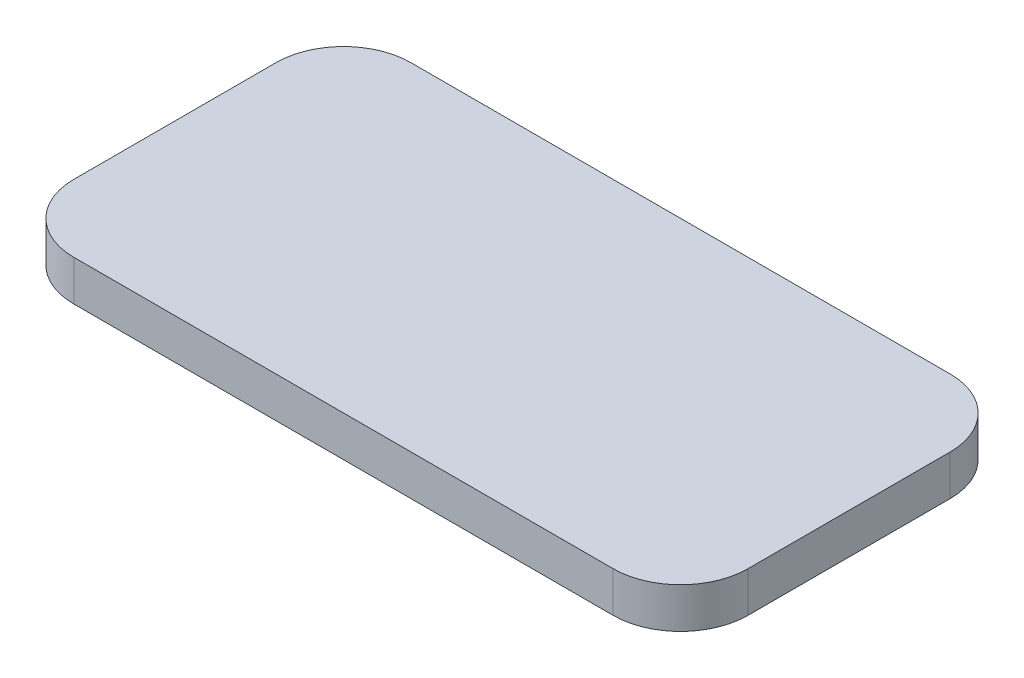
ISO-10303-21;
HEADER;
FILE_DESCRIPTION(('STEP AP214'),'2;1');
FILE_NAME('part.step','',(''),(''),'','','');
FILE_SCHEMA(('AUTOMOTIVE_DESIGN { 1 0 10303 214 1 1 1 1 }'));
ENDSEC;
DATA;
#1=APPLICATION_CONTEXT('core data for automotive mechanical design processes');
#2=APPLICATION_PROTOCOL_DEFINITION('international standard','automotive_design',2000,#1);
#3=PRODUCT_CONTEXT('',#1,'mechanical');
#4=PRODUCT('Part','Part','',(#3));
#5=PRODUCT_RELATED_PRODUCT_CATEGORY('part','',(#4));
#6=PRODUCT_DEFINITION_FORMATION('','',#4);
#7=PRODUCT_DEFINITION_CONTEXT('part definition',#1,'design');
#8=PRODUCT_DEFINITION('design','',#6,#7);
#9=PRODUCT_DEFINITION_SHAPE('','',#8);
#10=(LENGTH_UNIT() NAMED_UNIT(*) SI_UNIT(.MILLI.,.METRE.));
#11=(NAMED_UNIT(*) PLANE_ANGLE_UNIT() SI_UNIT($,.RADIAN.));
#12=(NAMED_UNIT(*) SI_UNIT($,.STERADIAN.) SOLID_ANGLE_UNIT());
#13=UNCERTAINTY_MEASURE_WITH_UNIT(LENGTH_MEASURE(1.E-05),#10,'distance_accuracy_value','');
#14=(GEOMETRIC_REPRESENTATION_CONTEXT(3) GLOBAL_UNCERTAINTY_ASSIGNED_CONTEXT((#13)) GLOBAL_UNIT_ASSIGNED_CONTEXT((#10,
#11,#12)) REPRESENTATION_CONTEXT('',''));
#15=CARTESIAN_POINT('',(0.,0.,0.));
#16=DIRECTION('',(0.,0.,1.));
#17=DIRECTION('',(1.,0.,0.));
#18=AXIS2_PLACEMENT_3D('',#15,#16,#17);
#19=CARTESIAN_POINT('',(5.,3.,-20.));
#20=DIRECTION('',(0.,-1.,0.));
#21=DIRECTION('',(0.,0.,-1.));
#22=AXIS2_PLACEMENT_3D('',#19,#20,#21);
#23=CYLINDRICAL_SURFACE('',#22,5.);
#24=CARTESIAN_POINT('',(5.,0.,-20.));
#25=DIRECTION('',(0.,1.,0.));
#26=DIRECTION('',(0.,0.,1.));
#27=AXIS2_PLACEMENT_3D('',#24,#25,#26);
#28=CIRCLE('',#27,5.);
#29=CARTESIAN_POINT('',(5.,0.,-25.));
#30=VERTEX_POINT('',#29);
#31=CARTESIAN_POINT('',(0.,0.,-20.));
#32=VERTEX_POINT('',#31);
#33=EDGE_CURVE('E96',#30,#32,#28,.T.);
#34=ORIENTED_EDGE('',*,*,#33,.T.);
#35=DIRECTION('',(0.,-1.,0.));
#36=VECTOR('',#35,1.);
#37=CARTESIAN_POINT('',(0.,3.,-20.));
#38=LINE('',#37,#36);
#39=CARTESIAN_POINT('',(0.,3.,-20.));
#40=VERTEX_POINT('',#39);
#41=EDGE_CURVE('E11',#40,#32,#38,.T.);
#42=ORIENTED_EDGE('',*,*,#41,.F.);
#43=CARTESIAN_POINT('',(5.,3.,-20.));
#44=DIRECTION('',(0.,1.,0.));
#45=DIRECTION('',(0.,0.,1.));
#46=AXIS2_PLACEMENT_3D('',#43,#44,#45);
#47=CIRCLE('',#46,5.);
#48=CARTESIAN_POINT('',(5.,3.,-25.));
#49=VERTEX_POINT('',#48);
#50=EDGE_CURVE('E123',#49,#40,#47,.T.);
#51=ORIENTED_EDGE('',*,*,#50,.F.);
#52=DIRECTION('',(0.,-1.,0.));
#53=VECTOR('',#52,1.);
#54=CARTESIAN_POINT('',(5.,3.,-25.));
#55=LINE('',#54,#53);
#56=EDGE_CURVE('E109',#49,#30,#55,.T.);
#57=ORIENTED_EDGE('',*,*,#56,.T.);
#58=EDGE_LOOP('',(#34,#42,#51,#57));
#59=FACE_BOUND('',#58,.T.);
#60=ADVANCED_FACE('F28',(#59),#23,.T.);
#61=CARTESIAN_POINT('',(0.,3.,-5.));
#62=DIRECTION('',(1.,0.,0.));
#63=DIRECTION('',(0.,0.,-1.));
#64=AXIS2_PLACEMENT_3D('',#61,#62,#63);
#65=PLANE('',#64);
#66=DIRECTION('',(0.,0.,1.));
#67=VECTOR('',#66,1.);
#68=CARTESIAN_POINT('',(0.,0.,-5.));
#69=LINE('',#68,#67);
#70=CARTESIAN_POINT('',(0.,0.,-5.));
#71=VERTEX_POINT('',#70);
#72=EDGE_CURVE('E92',#32,#71,#69,.T.);
#73=ORIENTED_EDGE('',*,*,#72,.T.);
#74=DIRECTION('',(0.,-1.,0.));
#75=VECTOR('',#74,1.);
#76=CARTESIAN_POINT('',(0.,3.,-5.));
#77=LINE('',#76,#75);
#78=CARTESIAN_POINT('',(0.,3.,-5.));
#79=VERTEX_POINT('',#78);
#80=EDGE_CURVE('E35',#79,#71,#77,.T.);
#81=ORIENTED_EDGE('',*,*,#80,.F.);
#82=DIRECTION('',(0.,0.,1.));
#83=VECTOR('',#82,1.);
#84=CARTESIAN_POINT('',(0.,3.,-5.));
#85=LINE('',#84,#83);
#86=EDGE_CURVE('E105',#40,#79,#85,.T.);
#87=ORIENTED_EDGE('',*,*,#86,.F.);
#88=ORIENTED_EDGE('',*,*,#41,.T.);
#89=EDGE_LOOP('',(#73,#81,#87,#88));
#90=FACE_BOUND('',#89,.T.);
#91=ADVANCED_FACE('F104',(#90),#65,.F.);
#92=CARTESIAN_POINT('',(5.,3.,-5.));
#93=DIRECTION('',(0.,-1.,0.));
#94=DIRECTION('',(0.,0.,-1.));
#95=AXIS2_PLACEMENT_3D('',#92,#93,#94);
#96=CYLINDRICAL_SURFACE('',#95,5.);
#97=CARTESIAN_POINT('',(5.,0.,-5.));
#98=DIRECTION('',(0.,1.,0.));
#99=DIRECTION('',(0.,0.,1.));
#100=AXIS2_PLACEMENT_3D('',#97,#98,#99);
#101=CIRCLE('',#100,5.);
#102=CARTESIAN_POINT('',(5.,0.,0.));
#103=VERTEX_POINT('',#102);
#104=EDGE_CURVE('E98',#71,#103,#101,.T.);
#105=ORIENTED_EDGE('',*,*,#104,.T.);
#106=DIRECTION('',(0.,-1.,0.));
#107=VECTOR('',#106,1.);
#108=CARTESIAN_POINT('',(5.,3.,0.));
#109=LINE('',#108,#107);
#110=CARTESIAN_POINT('',(5.,3.,0.));
#111=VERTEX_POINT('',#110);
#112=EDGE_CURVE('E149',#111,#103,#109,.T.);
#113=ORIENTED_EDGE('',*,*,#112,.F.);
#114=CARTESIAN_POINT('',(5.,3.,-5.));
#115=DIRECTION('',(0.,1.,0.));
#116=DIRECTION('',(0.,0.,1.));
#117=AXIS2_PLACEMENT_3D('',#114,#115,#116);
#118=CIRCLE('',#117,5.);
#119=EDGE_CURVE('E126',#79,#111,#118,.T.);
#120=ORIENTED_EDGE('',*,*,#119,.F.);
#121=ORIENTED_EDGE('',*,*,#80,.T.);
#122=EDGE_LOOP('',(#105,#113,#120,#121));
#123=FACE_BOUND('',#122,.T.);
#124=ADVANCED_FACE('F153',(#123),#96,.T.);
#125=CARTESIAN_POINT('',(5.,3.,0.));
#126=DIRECTION('',(0.,0.,-1.));
#127=DIRECTION('',(-1.,0.,0.));
#128=AXIS2_PLACEMENT_3D('',#125,#126,#127);
#129=PLANE('',#128);
#130=DIRECTION('',(1.,0.,0.));
#131=VECTOR('',#130,1.);
#132=CARTESIAN_POINT('',(5.,0.,0.));
#133=LINE('',#132,#131);
#134=CARTESIAN_POINT('',(45.,0.,0.));
#135=VERTEX_POINT('',#134);
#136=EDGE_CURVE('E113',#103,#135,#133,.T.);
#137=ORIENTED_EDGE('',*,*,#136,.T.);
#138=DIRECTION('',(0.,-1.,0.));
#139=VECTOR('',#138,1.);
#140=CARTESIAN_POINT('',(45.,3.,0.));
#141=LINE('',#140,#139);
#142=CARTESIAN_POINT('',(45.,3.,0.));
#143=VERTEX_POINT('',#142);
#144=EDGE_CURVE('E146',#143,#135,#141,.T.);
#145=ORIENTED_EDGE('',*,*,#144,.F.);
#146=DIRECTION('',(1.,0.,0.));
#147=VECTOR('',#146,1.);
#148=CARTESIAN_POINT('',(5.,3.,0.));
#149=LINE('',#148,#147);
#150=EDGE_CURVE('E128',#111,#143,#149,.T.);
#151=ORIENTED_EDGE('',*,*,#150,.F.);
#152=ORIENTED_EDGE('',*,*,#112,.T.);
#153=EDGE_LOOP('',(#137,#145,#151,#152));
#154=FACE_BOUND('',#153,.T.);
#155=ADVANCED_FACE('F161',(#154),#129,.F.);
#156=CARTESIAN_POINT('',(45.,3.,-5.));
#157=DIRECTION('',(0.,-1.,0.));
#158=DIRECTION('',(0.,0.,-1.));
#159=AXIS2_PLACEMENT_3D('',#156,#157,#158);
#160=CYLINDRICAL_SURFACE('',#159,5.);
#161=CARTESIAN_POINT('',(45.,0.,-5.));
#162=DIRECTION('',(0.,1.,0.));
#163=DIRECTION('',(0.,0.,-1.));
#164=AXIS2_PLACEMENT_3D('',#161,#162,#163);
#165=CIRCLE('',#164,5.);
#166=CARTESIAN_POINT('',(50.,0.,-5.));
#167=VERTEX_POINT('',#166);
#168=EDGE_CURVE('E115',#135,#167,#165,.T.);
#169=ORIENTED_EDGE('',*,*,#168,.T.);
#170=DIRECTION('',(0.,-1.,0.));
#171=VECTOR('',#170,1.);
#172=CARTESIAN_POINT('',(50.,3.,-5.));
#173=LINE('',#172,#171);
#174=CARTESIAN_POINT('',(50.,3.,-5.));
#175=VERTEX_POINT('',#174);
#176=EDGE_CURVE('E143',#175,#167,#173,.T.);
#177=ORIENTED_EDGE('',*,*,#176,.F.);
#178=CARTESIAN_POINT('',(45.,3.,-5.));
#179=DIRECTION('',(0.,1.,0.));
#180=DIRECTION('',(0.,0.,-1.));
#181=AXIS2_PLACEMENT_3D('',#178,#179,#180);
#182=CIRCLE('',#181,5.);
#183=EDGE_CURVE('E130',#143,#175,#182,.T.);
#184=ORIENTED_EDGE('',*,*,#183,.F.);
#185=ORIENTED_EDGE('',*,*,#144,.T.);
#186=EDGE_LOOP('',(#169,#177,#184,#185));
#187=FACE_BOUND('',#186,.T.);
#188=ADVANCED_FACE('F164',(#187),#160,.T.);
#189=CARTESIAN_POINT('',(50.,3.,-5.));
#190=DIRECTION('',(-1.,0.,0.));
#191=DIRECTION('',(0.,0.,1.));
#192=AXIS2_PLACEMENT_3D('',#189,#190,#191);
#193=PLANE('',#192);
#194=DIRECTION('',(0.,0.,-1.));
#195=VECTOR('',#194,1.);
#196=CARTESIAN_POINT('',(50.,0.,-5.));
#197=LINE('',#196,#195);
#198=CARTESIAN_POINT('',(50.,0.,-20.));
#199=VERTEX_POINT('',#198);
#200=EDGE_CURVE('E117',#167,#199,#197,.T.);
#201=ORIENTED_EDGE('',*,*,#200,.T.);
#202=DIRECTION('',(0.,-1.,0.));
#203=VECTOR('',#202,1.);
#204=CARTESIAN_POINT('',(50.,3.,-20.));
#205=LINE('',#204,#203);
#206=CARTESIAN_POINT('',(50.,3.,-20.));
#207=VERTEX_POINT('',#206);
#208=EDGE_CURVE('E140',#207,#199,#205,.T.);
#209=ORIENTED_EDGE('',*,*,#208,.F.);
#210=DIRECTION('',(0.,0.,-1.));
#211=VECTOR('',#210,1.);
#212=CARTESIAN_POINT('',(50.,3.,-5.));
#213=LINE('',#212,#211);
#214=EDGE_CURVE('E132',#175,#207,#213,.T.);
#215=ORIENTED_EDGE('',*,*,#214,.F.);
#216=ORIENTED_EDGE('',*,*,#176,.T.);
#217=EDGE_LOOP('',(#201,#209,#215,#216));
#218=FACE_BOUND('',#217,.T.);
#219=ADVANCED_FACE('F169',(#218),#193,.F.);
#220=CARTESIAN_POINT('',(45.,3.,-20.));
#221=DIRECTION('',(0.,-1.,0.));
#222=DIRECTION('',(0.,0.,-1.));
#223=AXIS2_PLACEMENT_3D('',#220,#221,#222);
#224=CYLINDRICAL_SURFACE('',#223,5.);
#225=CARTESIAN_POINT('',(45.,0.,-20.));
#226=DIRECTION('',(0.,1.,0.));
#227=DIRECTION('',(0.,0.,1.));
#228=AXIS2_PLACEMENT_3D('',#225,#226,#227);
#229=CIRCLE('',#228,5.);
#230=CARTESIAN_POINT('',(45.,0.,-25.));
#231=VERTEX_POINT('',#230);
#232=EDGE_CURVE('E119',#199,#231,#229,.T.);
#233=ORIENTED_EDGE('',*,*,#232,.T.);
#234=DIRECTION('',(0.,-1.,0.));
#235=VECTOR('',#234,1.);
#236=CARTESIAN_POINT('',(45.,3.,-25.));
#237=LINE('',#236,#235);
#238=CARTESIAN_POINT('',(45.,3.,-25.));
#239=VERTEX_POINT('',#238);
#240=EDGE_CURVE('E137',#239,#231,#237,.T.);
#241=ORIENTED_EDGE('',*,*,#240,.F.);
#242=CARTESIAN_POINT('',(45.,3.,-20.));
#243=DIRECTION('',(0.,1.,0.));
#244=DIRECTION('',(0.,0.,1.));
#245=AXIS2_PLACEMENT_3D('',#242,#243,#244);
#246=CIRCLE('',#245,5.);
#247=EDGE_CURVE('E47',#207,#239,#246,.T.);
#248=ORIENTED_EDGE('',*,*,#247,.F.);
#249=ORIENTED_EDGE('',*,*,#208,.T.);
#250=EDGE_LOOP('',(#233,#241,#248,#249));
#251=FACE_BOUND('',#250,.T.);
#252=ADVANCED_FACE('F172',(#251),#224,.T.);
#253=CARTESIAN_POINT('',(5.,3.,-25.));
#254=DIRECTION('',(0.,0.,1.));
#255=DIRECTION('',(1.,0.,0.));
#256=AXIS2_PLACEMENT_3D('',#253,#254,#255);
#257=PLANE('',#256);
#258=DIRECTION('',(-1.,0.,0.));
#259=VECTOR('',#258,1.);
#260=CARTESIAN_POINT('',(5.,0.,-25.));
#261=LINE('',#260,#259);
#262=EDGE_CURVE('E121',#231,#30,#261,.T.);
#263=ORIENTED_EDGE('',*,*,#262,.T.);
#264=ORIENTED_EDGE('',*,*,#56,.F.);
#265=DIRECTION('',(-1.,0.,0.));
#266=VECTOR('',#265,1.);
#267=CARTESIAN_POINT('',(5.,3.,-25.));
#268=LINE('',#267,#266);
#269=EDGE_CURVE('E42',#239,#49,#268,.T.);
#270=ORIENTED_EDGE('',*,*,#269,.F.);
#271=ORIENTED_EDGE('',*,*,#240,.T.);
#272=EDGE_LOOP('',(#263,#264,#270,#271));
#273=FACE_BOUND('',#272,.T.);
#274=ADVANCED_FACE('F174',(#273),#257,.F.);
#275=CARTESIAN_POINT('',(5.,3.,-20.));
#276=DIRECTION('',(0.,1.,0.));
#277=DIRECTION('',(0.,0.,1.));
#278=AXIS2_PLACEMENT_3D('',#275,#276,#277);
#279=PLANE('',#278);
#280=ORIENTED_EDGE('',*,*,#50,.T.);
#281=ORIENTED_EDGE('',*,*,#86,.T.);
#282=ORIENTED_EDGE('',*,*,#119,.T.);
#283=ORIENTED_EDGE('',*,*,#150,.T.);
#284=ORIENTED_EDGE('',*,*,#183,.T.);
#285=ORIENTED_EDGE('',*,*,#214,.T.);
#286=ORIENTED_EDGE('',*,*,#247,.T.);
#287=ORIENTED_EDGE('',*,*,#269,.T.);
#288=EDGE_LOOP('',(#280,#281,#282,#283,#284,#285,#286,#287));
#289=FACE_BOUND('',#288,.T.);
#290=ADVANCED_FACE('F156',(#289),#279,.T.);
#291=CARTESIAN_POINT('',(5.,0.,-20.));
#292=DIRECTION('',(0.,1.,0.));
#293=DIRECTION('',(0.,0.,1.));
#294=AXIS2_PLACEMENT_3D('',#291,#292,#293);
#295=PLANE('',#294);
#296=ORIENTED_EDGE('',*,*,#33,.F.);
#297=ORIENTED_EDGE('',*,*,#262,.F.);
#298=ORIENTED_EDGE('',*,*,#232,.F.);
#299=ORIENTED_EDGE('',*,*,#200,.F.);
#300=ORIENTED_EDGE('',*,*,#168,.F.);
#301=ORIENTED_EDGE('',*,*,#136,.F.);
#302=ORIENTED_EDGE('',*,*,#104,.F.);
#303=ORIENTED_EDGE('',*,*,#72,.F.);
#304=EDGE_LOOP('',(#296,#297,#298,#299,#300,#301,#302,#303));
#305=FACE_BOUND('',#304,.T.);
#306=ADVANCED_FACE('F93',(#305),#295,.F.);
#307=CLOSED_SHELL('',(#60,#91,#124,#155,#188,#219,#252,#274,#290,#306));
#308=MANIFOLD_SOLID_BREP('B2',#307);
#309=ADVANCED_BREP_SHAPE_REPRESENTATION('',(#18,#308),#14);
#310=SHAPE_DEFINITION_REPRESENTATION(#9,#309);
ENDSEC;
END-ISO-10303-21;
